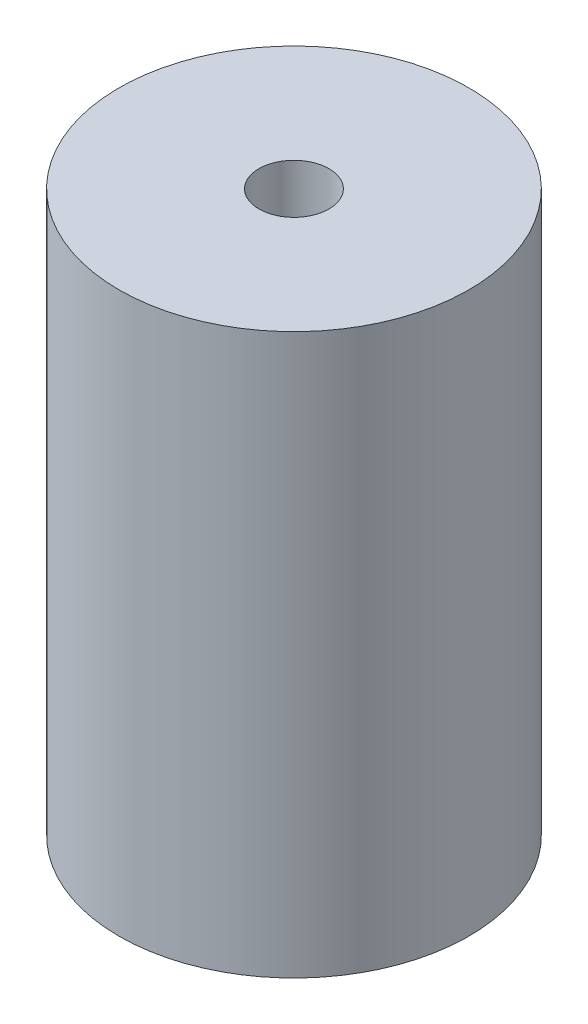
ISO-10303-21;
HEADER;
FILE_DESCRIPTION(('STEP AP214'),'2;1');
FILE_NAME('part.step','',(''),(''),'','','');
FILE_SCHEMA(('AUTOMOTIVE_DESIGN { 1 0 10303 214 1 1 1 1 }'));
ENDSEC;
DATA;
#1=APPLICATION_CONTEXT('core data for automotive mechanical design processes');
#2=APPLICATION_PROTOCOL_DEFINITION('international standard','automotive_design',2000,#1);
#3=PRODUCT_CONTEXT('',#1,'mechanical');
#4=PRODUCT('Part','Part','',(#3));
#5=PRODUCT_RELATED_PRODUCT_CATEGORY('part','',(#4));
#6=PRODUCT_DEFINITION_FORMATION('','',#4);
#7=PRODUCT_DEFINITION_CONTEXT('part definition',#1,'design');
#8=PRODUCT_DEFINITION('design','',#6,#7);
#9=PRODUCT_DEFINITION_SHAPE('','',#8);
#10=(LENGTH_UNIT() NAMED_UNIT(*) SI_UNIT(.MILLI.,.METRE.));
#11=(NAMED_UNIT(*) PLANE_ANGLE_UNIT() SI_UNIT($,.RADIAN.));
#12=(NAMED_UNIT(*) SI_UNIT($,.STERADIAN.) SOLID_ANGLE_UNIT());
#13=UNCERTAINTY_MEASURE_WITH_UNIT(LENGTH_MEASURE(1.E-05),#10,'distance_accuracy_value','');
#14=(GEOMETRIC_REPRESENTATION_CONTEXT(3) GLOBAL_UNCERTAINTY_ASSIGNED_CONTEXT((#13)) GLOBAL_UNIT_ASSIGNED_CONTEXT((#10,
#11,#12)) REPRESENTATION_CONTEXT('',''));
#15=CARTESIAN_POINT('',(0.,0.,0.));
#16=DIRECTION('',(0.,0.,1.));
#17=DIRECTION('',(1.,0.,0.));
#18=AXIS2_PLACEMENT_3D('',#15,#16,#17);
#19=CARTESIAN_POINT('',(0.,16.,0.));
#20=DIRECTION('',(0.,1.,0.));
#21=DIRECTION('',(0.,0.,1.));
#22=AXIS2_PLACEMENT_3D('',#19,#20,#21);
#23=PLANE('',#22);
#24=CARTESIAN_POINT('',(0.,16.,0.));
#25=DIRECTION('',(0.,1.,0.));
#26=DIRECTION('',(0.,0.,1.));
#27=AXIS2_PLACEMENT_3D('',#24,#25,#26);
#28=CIRCLE('',#27,5.);
#29=CARTESIAN_POINT('',(0.,16.,5.));
#30=VERTEX_POINT('',#29);
#31=EDGE_CURVE('E10',#30,#30,#28,.T.);
#32=ORIENTED_EDGE('',*,*,#31,.T.);
#33=EDGE_LOOP('',(#32));
#34=FACE_BOUND('',#33,.T.);
#35=CARTESIAN_POINT('',(0.,16.,0.));
#36=DIRECTION('',(0.,1.,0.));
#37=DIRECTION('',(0.,0.,1.));
#38=AXIS2_PLACEMENT_3D('',#35,#36,#37);
#39=CIRCLE('',#38,1.);
#40=CARTESIAN_POINT('',(0.,16.,1.));
#41=VERTEX_POINT('',#40);
#42=EDGE_CURVE('E39',#41,#41,#39,.T.);
#43=ORIENTED_EDGE('',*,*,#42,.F.);
#44=EDGE_LOOP('',(#43));
#45=FACE_BOUND('',#44,.T.);
#46=ADVANCED_FACE('F28',(#34,#45),#23,.T.);
#47=CARTESIAN_POINT('',(0.,0.,0.));
#48=DIRECTION('',(0.,1.,0.));
#49=DIRECTION('',(0.,0.,1.));
#50=AXIS2_PLACEMENT_3D('',#47,#48,#49);
#51=PLANE('',#50);
#52=CARTESIAN_POINT('',(0.,0.,0.));
#53=DIRECTION('',(0.,1.,0.));
#54=DIRECTION('',(0.,0.,1.));
#55=AXIS2_PLACEMENT_3D('',#52,#53,#54);
#56=CIRCLE('',#55,5.);
#57=CARTESIAN_POINT('',(0.,0.,5.));
#58=VERTEX_POINT('',#57);
#59=EDGE_CURVE('E35',#58,#58,#56,.T.);
#60=ORIENTED_EDGE('',*,*,#59,.F.);
#61=EDGE_LOOP('',(#60));
#62=FACE_BOUND('',#61,.T.);
#63=CARTESIAN_POINT('',(0.,0.,0.));
#64=DIRECTION('',(0.,1.,0.));
#65=DIRECTION('',(0.,0.,1.));
#66=AXIS2_PLACEMENT_3D('',#63,#64,#65);
#67=CIRCLE('',#66,1.);
#68=CARTESIAN_POINT('',(0.,0.,1.));
#69=VERTEX_POINT('',#68);
#70=EDGE_CURVE('E43',#69,#69,#67,.T.);
#71=ORIENTED_EDGE('',*,*,#70,.T.);
#72=EDGE_LOOP('',(#71));
#73=FACE_BOUND('',#72,.T.);
#74=ADVANCED_FACE('F49',(#62,#73),#51,.F.);
#75=CARTESIAN_POINT('',(0.,16.,0.));
#76=DIRECTION('',(0.,-1.,0.));
#77=DIRECTION('',(0.,0.,-1.));
#78=AXIS2_PLACEMENT_3D('',#75,#76,#77);
#79=CYLINDRICAL_SURFACE('',#78,5.);
#80=ORIENTED_EDGE('',*,*,#31,.F.);
#81=EDGE_LOOP('',(#80));
#82=FACE_BOUND('',#81,.T.);
#83=ORIENTED_EDGE('',*,*,#59,.T.);
#84=EDGE_LOOP('',(#83));
#85=FACE_BOUND('',#84,.T.);
#86=ADVANCED_FACE('F30',(#82,#85),#79,.T.);
#87=CARTESIAN_POINT('',(0.,16.,0.));
#88=DIRECTION('',(0.,-1.,0.));
#89=DIRECTION('',(0.,0.,-1.));
#90=AXIS2_PLACEMENT_3D('',#87,#88,#89);
#91=CYLINDRICAL_SURFACE('',#90,1.);
#92=ORIENTED_EDGE('',*,*,#42,.T.);
#93=EDGE_LOOP('',(#92));
#94=FACE_BOUND('',#93,.T.);
#95=ORIENTED_EDGE('',*,*,#70,.F.);
#96=EDGE_LOOP('',(#95));
#97=FACE_BOUND('',#96,.T.);
#98=ADVANCED_FACE('F51',(#94,#97),#91,.F.);
#99=CLOSED_SHELL('',(#46,#74,#86,#98));
#100=MANIFOLD_SOLID_BREP('B2',#99);
#101=ADVANCED_BREP_SHAPE_REPRESENTATION('',(#18,#100),#14);
#102=SHAPE_DEFINITION_REPRESENTATION(#9,#101);
ENDSEC;
END-ISO-10303-21;
